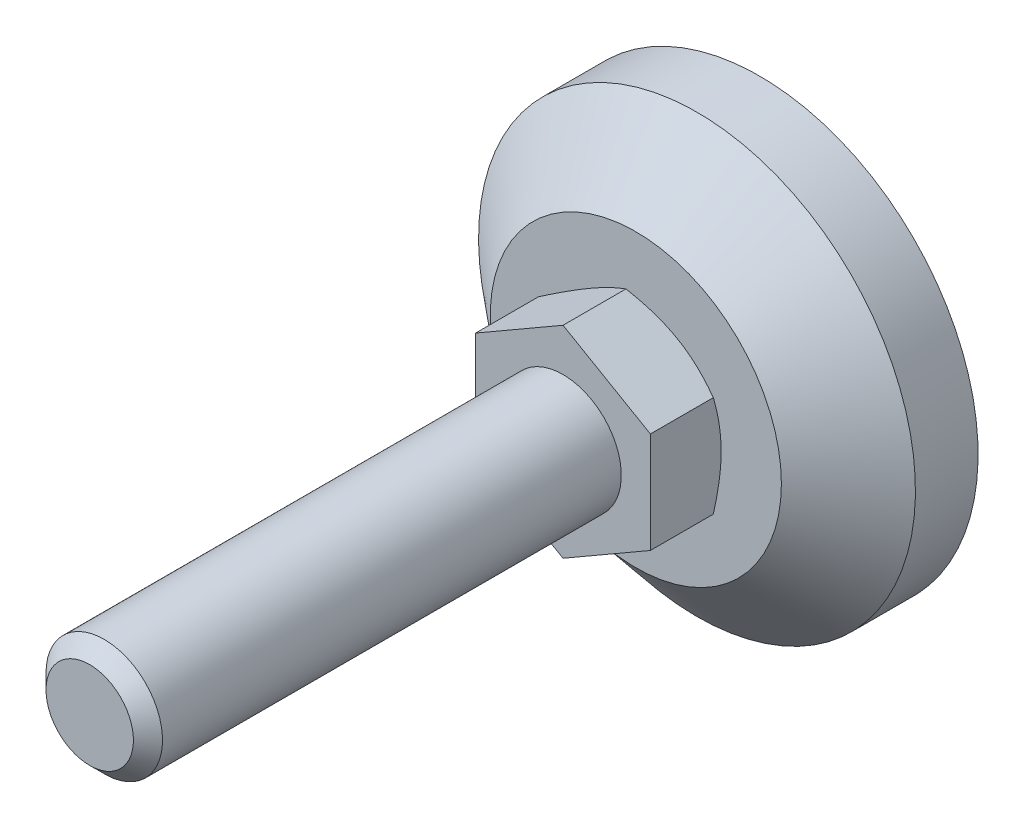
ISO-10303-21;
HEADER;
FILE_DESCRIPTION(('STEP AP214'),'2;1');
FILE_NAME('part.step','',(''),(''),'','','');
FILE_SCHEMA(('AUTOMOTIVE_DESIGN { 1 0 10303 214 1 1 1 1 }'));
ENDSEC;
DATA;
#1=APPLICATION_CONTEXT('core data for automotive mechanical design processes');
#2=APPLICATION_PROTOCOL_DEFINITION('international standard','automotive_design',2000,#1);
#3=PRODUCT_CONTEXT('',#1,'mechanical');
#4=PRODUCT('Part','Part','',(#3));
#5=PRODUCT_RELATED_PRODUCT_CATEGORY('part','',(#4));
#6=PRODUCT_DEFINITION_FORMATION('','',#4);
#7=PRODUCT_DEFINITION_CONTEXT('part definition',#1,'design');
#8=PRODUCT_DEFINITION('design','',#6,#7);
#9=PRODUCT_DEFINITION_SHAPE('','',#8);
#10=(LENGTH_UNIT() NAMED_UNIT(*) SI_UNIT(.MILLI.,.METRE.));
#11=(NAMED_UNIT(*) PLANE_ANGLE_UNIT() SI_UNIT($,.RADIAN.));
#12=(NAMED_UNIT(*) SI_UNIT($,.STERADIAN.) SOLID_ANGLE_UNIT());
#13=UNCERTAINTY_MEASURE_WITH_UNIT(LENGTH_MEASURE(1.E-05),#10,'distance_accuracy_value','');
#14=(GEOMETRIC_REPRESENTATION_CONTEXT(3) GLOBAL_UNCERTAINTY_ASSIGNED_CONTEXT((#13)) GLOBAL_UNIT_ASSIGNED_CONTEXT((#10,
#11,#12)) REPRESENTATION_CONTEXT('',''));
#15=CARTESIAN_POINT('',(0.,0.,0.));
#16=DIRECTION('',(0.,0.,1.));
#17=DIRECTION('',(1.,0.,0.));
#18=AXIS2_PLACEMENT_3D('',#15,#16,#17);
#19=CARTESIAN_POINT('',(0.,0.,27.));
#20=DIRECTION('',(0.,0.,1.));
#21=DIRECTION('',(0.5,-0.866025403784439,0.));
#22=AXIS2_PLACEMENT_3D('',#19,#20,#21);
#23=PLANE('',#22);
#24=DIRECTION('',(0.,1.,0.));
#25=VECTOR('',#24,1.);
#26=CARTESIAN_POINT('',(12.,-6.92820323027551,27.));
#27=LINE('',#26,#25);
#28=CARTESIAN_POINT('',(12.,-6.92820323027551,27.));
#29=VERTEX_POINT('',#28);
#30=CARTESIAN_POINT('',(12.,6.92820323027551,27.));
#31=VERTEX_POINT('',#30);
#32=EDGE_CURVE('E197',#29,#31,#27,.T.);
#33=ORIENTED_EDGE('',*,*,#32,.T.);
#34=DIRECTION('',(-0.866025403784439,0.5,0.));
#35=VECTOR('',#34,1.);
#36=CARTESIAN_POINT('',(12.,6.92820323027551,27.));
#37=LINE('',#36,#35);
#38=CARTESIAN_POINT('',(0.,13.856406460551,27.));
#39=VERTEX_POINT('',#38);
#40=EDGE_CURVE('E320',#31,#39,#37,.T.);
#41=ORIENTED_EDGE('',*,*,#40,.T.);
#42=DIRECTION('',(-0.866025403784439,-0.5,0.));
#43=VECTOR('',#42,1.);
#44=CARTESIAN_POINT('',(0.,13.856406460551,27.));
#45=LINE('',#44,#43);
#46=CARTESIAN_POINT('',(-12.,6.92820323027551,27.));
#47=VERTEX_POINT('',#46);
#48=EDGE_CURVE('E319',#39,#47,#45,.T.);
#49=ORIENTED_EDGE('',*,*,#48,.T.);
#50=DIRECTION('',(0.,-1.,0.));
#51=VECTOR('',#50,1.);
#52=CARTESIAN_POINT('',(-12.,6.92820323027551,27.));
#53=LINE('',#52,#51);
#54=CARTESIAN_POINT('',(-12.,-6.92820323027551,27.));
#55=VERTEX_POINT('',#54);
#56=EDGE_CURVE('E324',#47,#55,#53,.T.);
#57=ORIENTED_EDGE('',*,*,#56,.T.);
#58=DIRECTION('',(0.866025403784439,-0.5,0.));
#59=VECTOR('',#58,1.);
#60=CARTESIAN_POINT('',(-12.,-6.92820323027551,27.));
#61=LINE('',#60,#59);
#62=CARTESIAN_POINT('',(0.,-13.856406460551,27.));
#63=VERTEX_POINT('',#62);
#64=EDGE_CURVE('E326',#55,#63,#61,.T.);
#65=ORIENTED_EDGE('',*,*,#64,.T.);
#66=DIRECTION('',(0.866025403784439,0.5,0.));
#67=VECTOR('',#66,1.);
#68=CARTESIAN_POINT('',(0.,-13.856406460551,27.));
#69=LINE('',#68,#67);
#70=EDGE_CURVE('E37',#63,#29,#69,.T.);
#71=ORIENTED_EDGE('',*,*,#70,.T.);
#72=EDGE_LOOP('',(#33,#41,#49,#57,#65,#71));
#73=FACE_BOUND('',#72,.T.);
#74=CARTESIAN_POINT('',(0.,0.,27.));
#75=DIRECTION('',(0.,0.,1.));
#76=DIRECTION('',(0.5,-0.866025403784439,0.));
#77=AXIS2_PLACEMENT_3D('',#74,#75,#76);
#78=CIRCLE('',#77,8.);
#79=CARTESIAN_POINT('',(4.,-6.92820323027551,27.));
#80=VERTEX_POINT('',#79);
#81=EDGE_CURVE('E201',#80,#80,#78,.T.);
#82=ORIENTED_EDGE('',*,*,#81,.F.);
#83=EDGE_LOOP('',(#82));
#84=FACE_BOUND('',#83,.T.);
#85=ADVANCED_FACE('F14',(#73,#84),#23,.T.);
#86=CARTESIAN_POINT('',(-9.99463491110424,17.3112154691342,17.));
#87=DIRECTION('',(0.,0.,1.));
#88=DIRECTION('',(0.5,-0.866025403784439,0.));
#89=AXIS2_PLACEMENT_3D('',#86,#87,#88);
#90=PLANE('',#89);
#91=CARTESIAN_POINT('',(0.,0.,17.));
#92=DIRECTION('',(0.,0.,-1.));
#93=DIRECTION('',(-0.5,0.866025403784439,0.));
#94=AXIS2_PLACEMENT_3D('',#91,#92,#93);
#95=CIRCLE('',#94,19.9892698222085);
#96=CARTESIAN_POINT('',(-9.99463491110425,17.3112154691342,17.));
#97=VERTEX_POINT('',#96);
#98=EDGE_CURVE('E102',#97,#97,#95,.T.);
#99=ORIENTED_EDGE('',*,*,#98,.F.);
#100=EDGE_LOOP('',(#99));
#101=FACE_BOUND('',#100,.T.);
#102=CARTESIAN_POINT('',(0.,0.,17.));
#103=DIRECTION('',(0.,0.,-1.));
#104=DIRECTION('',(-0.5,0.866025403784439,0.));
#105=AXIS2_PLACEMENT_3D('',#102,#103,#104);
#106=CIRCLE('',#105,11.5);
#107=CARTESIAN_POINT('',(-5.75,9.95929214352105,17.));
#108=VERTEX_POINT('',#107);
#109=EDGE_CURVE('E84',#108,#108,#106,.T.);
#110=ORIENTED_EDGE('',*,*,#109,.T.);
#111=EDGE_LOOP('',(#110));
#112=FACE_BOUND('',#111,.T.);
#113=ADVANCED_FACE('F174',(#101,#112),#90,.T.);
#114=CARTESIAN_POINT('',(0.,0.,0.));
#115=DIRECTION('',(0.,0.,-1.));
#116=DIRECTION('',(-0.5,0.866025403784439,0.));
#117=AXIS2_PLACEMENT_3D('',#114,#115,#116);
#118=PLANE('',#117);
#119=CARTESIAN_POINT('',(0.,0.,0.));
#120=DIRECTION('',(0.,0.,-1.));
#121=DIRECTION('',(-0.5,0.866025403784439,0.));
#122=AXIS2_PLACEMENT_3D('',#119,#120,#121);
#123=CIRCLE('',#122,30.);
#124=CARTESIAN_POINT('',(-15.,25.9807621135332,0.));
#125=VERTEX_POINT('',#124);
#126=EDGE_CURVE('E73',#125,#125,#123,.T.);
#127=ORIENTED_EDGE('',*,*,#126,.T.);
#128=EDGE_LOOP('',(#127));
#129=FACE_BOUND('',#128,.T.);
#130=ADVANCED_FACE('F177',(#129),#118,.T.);
#131=CARTESIAN_POINT('',(0.,0.,-75.4972525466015));
#132=DIRECTION('',(0.,0.,-1.));
#133=DIRECTION('',(-0.5,0.866025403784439,0.));
#134=AXIS2_PLACEMENT_3D('',#131,#132,#133);
#135=CYLINDRICAL_SURFACE('',#134,30.);
#136=CARTESIAN_POINT('',(0.,0.,8.6));
#137=DIRECTION('',(0.,0.,-1.));
#138=DIRECTION('',(-0.5,0.866025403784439,0.));
#139=AXIS2_PLACEMENT_3D('',#136,#137,#138);
#140=CIRCLE('',#139,30.);
#141=CARTESIAN_POINT('',(-15.,25.9807621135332,8.6));
#142=VERTEX_POINT('',#141);
#143=EDGE_CURVE('E105',#142,#142,#140,.T.);
#144=ORIENTED_EDGE('',*,*,#143,.T.);
#145=EDGE_LOOP('',(#144));
#146=FACE_BOUND('',#145,.T.);
#147=ORIENTED_EDGE('',*,*,#126,.F.);
#148=EDGE_LOOP('',(#147));
#149=FACE_BOUND('',#148,.T.);
#150=ADVANCED_FACE('F181',(#146,#149),#135,.T.);
#151=CARTESIAN_POINT('',(0.,0.,8.6));
#152=DIRECTION('',(0.,0.,-1.));
#153=DIRECTION('',(-0.5,0.866025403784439,0.));
#154=AXIS2_PLACEMENT_3D('',#151,#152,#153);
#155=CONICAL_SURFACE('',#154,30.,0.872664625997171);
#156=ORIENTED_EDGE('',*,*,#98,.T.);
#157=EDGE_LOOP('',(#156));
#158=FACE_BOUND('',#157,.T.);
#159=ORIENTED_EDGE('',*,*,#143,.F.);
#160=EDGE_LOOP('',(#159));
#161=FACE_BOUND('',#160,.T.);
#162=ADVANCED_FACE('F121',(#158,#161),#155,.T.);
#163=CARTESIAN_POINT('',(0.,0.,20.8975219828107));
#164=DIRECTION('',(0.,0.,1.));
#165=DIRECTION('',(0.5,-0.866025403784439,0.));
#166=AXIS2_PLACEMENT_3D('',#163,#164,#165);
#167=CONICAL_SURFACE('',#166,18.2507060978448,1.0471975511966);
#168=ORIENTED_EDGE('',*,*,#109,.F.);
#169=EDGE_LOOP('',(#168));
#170=FACE_BOUND('',#169,.T.);
#171=CARTESIAN_POINT('',(-10.1845483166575,-19.7364581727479,23.1830146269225));
#172=CARTESIAN_POINT('',(-9.95731802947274,-19.6052667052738,23.0555465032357));
#173=CARTESIAN_POINT('',(-9.72982292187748,-19.4739223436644,22.9287081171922));
#174=CARTESIAN_POINT('',(-9.27424782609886,-19.2108959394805,22.6764332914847));
#175=CARTESIAN_POINT('',(-9.04616783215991,-19.0792138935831,22.5509968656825));
#176=CARTESIAN_POINT('',(-8.360907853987,-18.6835788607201,22.1769716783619));
#177=CARTESIAN_POINT('',(-7.90277404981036,-18.4190751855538,21.930704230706));
#178=CARTESIAN_POINT('',(-6.98100239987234,-17.8868900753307,21.4445247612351));
#179=CARTESIAN_POINT('',(-6.51734820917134,-17.6191992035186,21.2046539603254));
#180=CARTESIAN_POINT('',(-5.58637620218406,-17.0817022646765,20.734620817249));
#181=CARTESIAN_POINT('',(-5.11905855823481,-16.8118962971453,20.5044580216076));
#182=CARTESIAN_POINT('',(-4.16467967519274,-16.2608853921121,20.0490896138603));
#183=CARTESIAN_POINT('',(-3.67747196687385,-15.9795958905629,19.82429119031));
#184=CARTESIAN_POINT('',(-2.69737824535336,-15.413738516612,19.3915182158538));
#185=CARTESIAN_POINT('',(-2.20449160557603,-15.1291702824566,19.1835455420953));
#186=CARTESIAN_POINT('',(-1.21317256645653,-14.5568319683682,18.7898295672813));
#187=CARTESIAN_POINT('',(-0.714753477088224,-14.2690695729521,18.6040419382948));
#188=CARTESIAN_POINT('',(0.289281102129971,-13.6893899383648,18.2605950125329));
#189=CARTESIAN_POINT('',(0.794894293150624,-13.3974740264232,18.1029269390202));
#190=CARTESIAN_POINT('',(1.55740346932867,-12.9572391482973,17.8936125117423));
#191=CARTESIAN_POINT('',(1.81154649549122,-12.8105096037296,17.82851512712));
#192=CARTESIAN_POINT('',(2.3215816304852,-12.5160406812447,17.7081511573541));
#193=CARTESIAN_POINT('',(2.57747370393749,-12.3683013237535,17.652884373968));
#194=CARTESIAN_POINT('',(3.09083535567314,-12.0719118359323,17.5531523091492));
#195=CARTESIAN_POINT('',(3.34830490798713,-11.9232617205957,17.5086868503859));
#196=CARTESIAN_POINT('',(3.86455433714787,-11.6252049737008,17.4314414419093));
#197=CARTESIAN_POINT('',(4.12333416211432,-11.4757983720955,17.3986610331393));
#198=CARTESIAN_POINT('',(4.63843364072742,-11.1784055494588,17.345852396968));
#199=CARTESIAN_POINT('',(4.89474072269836,-11.0304265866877,17.3256616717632));
#200=CARTESIAN_POINT('',(5.40786438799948,-10.7341745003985,17.2978182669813));
#201=CARTESIAN_POINT('',(5.66468096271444,-10.5859013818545,17.2901653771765));
#202=CARTESIAN_POINT('',(6.17836497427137,-10.2893257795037,17.287579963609));
#203=CARTESIAN_POINT('',(6.43523241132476,-10.1410232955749,17.2926474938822));
#204=CARTESIAN_POINT('',(6.94855188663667,-9.84465815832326,17.3153783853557));
#205=CARTESIAN_POINT('',(7.20500390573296,-9.69659551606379,17.3330423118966));
#206=CARTESIAN_POINT('',(7.81927447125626,-9.34194623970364,17.3900614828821));
#207=CARTESIAN_POINT('',(8.17669346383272,-9.13559028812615,17.4352607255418));
#208=CARTESIAN_POINT('',(8.88892563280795,-8.72438285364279,17.5476838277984));
#209=CARTESIAN_POINT('',(9.24373845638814,-8.51953157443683,17.6149106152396));
#210=CARTESIAN_POINT('',(9.95040329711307,-8.11153843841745,17.7689975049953));
#211=CARTESIAN_POINT('',(10.3022528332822,-7.90839801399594,17.8558726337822));
#212=CARTESIAN_POINT('',(11.0024455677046,-7.50414155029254,18.0466010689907));
#213=CARTESIAN_POINT('',(11.3507888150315,-7.30302548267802,18.1504541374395));
#214=CARTESIAN_POINT('',(12.0517118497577,-6.89834737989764,18.3750877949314));
#215=CARTESIAN_POINT('',(12.4042127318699,-6.69483090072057,18.4961943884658));
#216=CARTESIAN_POINT('',(13.1057427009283,-6.28980238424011,18.7510771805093));
#217=CARTESIAN_POINT('',(13.4547717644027,-6.08829036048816,18.8848534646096));
#218=CARTESIAN_POINT('',(14.1495287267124,-5.68717224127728,19.1629377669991));
#219=CARTESIAN_POINT('',(14.4952576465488,-5.48756555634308,19.3072424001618));
#220=CARTESIAN_POINT('',(15.1838410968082,-5.09001171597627,19.6046702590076));
#221=CARTESIAN_POINT('',(15.5266956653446,-4.89206453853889,19.7577933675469));
#222=CARTESIAN_POINT('',(16.3531119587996,-4.41493286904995,20.1371587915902));
#223=CARTESIAN_POINT('',(16.8353860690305,-4.13649178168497,20.3671360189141));
#224=CARTESIAN_POINT('',(17.7956874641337,-3.58206151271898,20.838658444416));
#225=CARTESIAN_POINT('',(18.2737144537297,-3.3060725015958,21.0802044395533));
#226=CARTESIAN_POINT('',(19.2263411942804,-2.75607319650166,21.572480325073));
#227=CARTESIAN_POINT('',(19.7009400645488,-2.48206341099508,21.8232124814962));
#228=CARTESIAN_POINT('',(20.647182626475,-1.93575001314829,22.3319518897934));
#229=CARTESIAN_POINT('',(21.1188263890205,-1.66344635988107,22.5899589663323));
#230=CARTESIAN_POINT('',(22.060219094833,-1.11993302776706,23.1121588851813));
#231=CARTESIAN_POINT('',(22.5299651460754,-0.848725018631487,23.3763586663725));
#232=CARTESIAN_POINT('',(23.4674052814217,-0.307493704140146,23.9095679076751));
#233=CARTESIAN_POINT('',(23.9350993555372,-0.037470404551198,24.1785773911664));
#234=CARTESIAN_POINT('',(24.8686924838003,0.50153983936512,24.7205226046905));
#235=CARTESIAN_POINT('',(25.3345917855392,0.770526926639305,24.9934577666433));
#236=CARTESIAN_POINT('',(26.2649273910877,1.30765643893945,25.5426344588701));
#237=CARTESIAN_POINT('',(26.7293636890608,1.57579886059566,25.8188760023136));
#238=CARTESIAN_POINT('',(28.0397530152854,2.33235249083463,26.6032315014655));
#239=CARTESIAN_POINT('',(28.8842584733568,2.81992794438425,27.1145698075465));
#240=CARTESIAN_POINT('',(30.5701660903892,3.79328716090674,28.1440983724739));
#241=CARTESIAN_POINT('',(31.4115681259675,4.27907085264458,28.6622889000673));
#242=CARTESIAN_POINT('',(33.0897202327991,5.24795242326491,29.7025139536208));
#243=CARTESIAN_POINT('',(33.9264767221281,5.73105400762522,30.2245346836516));
#244=CARTESIAN_POINT('',(35.1801565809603,6.45486641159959,31.0105887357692));
#245=CARTESIAN_POINT('',(35.5977953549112,6.69599027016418,31.2731029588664));
#246=CARTESIAN_POINT('',(36.4326440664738,7.17799039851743,31.7990373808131));
#247=CARTESIAN_POINT('',(36.8498540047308,7.41886666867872,32.0624575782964));
#248=CARTESIAN_POINT('',(37.2668741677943,7.65963337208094,32.3262778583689));
#249=B_SPLINE_CURVE_WITH_KNOTS('',3,(#171,#172,#173,#174,#175,#176,#177,#178,#179,#180,#181,
#182,#183,#184,#185,#186,#187,#188,#189,#190,#191,#192,#193,#194,#195,#196,#197,#198,#199,#200,
#201,#202,#203,#204,#205,#206,#207,#208,#209,#210,#211,#212,#213,#214,#215,#216,#217,#218,#219,
#220,#221,#222,#223,#224,#225,#226,#227,#228,#229,#230,#231,#232,#233,#234,#235,#236,#237,#238,
#239,#240,#241,#242,#243,#244,#245,#246,#247,#248),.UNSPECIFIED.,.F.,.F.,(4,2,2,2,2,2,2,2,2,2,2,
2,2,2,2,2,2,2,2,2,2,2,2,2,2,2,2,2,2,2,2,2,2,2,2,2,2,2,4),(0.,0.875119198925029,1.75024704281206,
3.50075771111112,5.26066680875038,7.02049360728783,8.8377767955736,10.6552624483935,
12.469053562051,14.2822775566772,15.1839173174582,16.085538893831,16.9871456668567,
17.8887170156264,18.7783966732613,19.6680614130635,20.5577299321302,21.4474383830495,
22.6922901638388,23.9373074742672,25.1832801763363,26.4292354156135,27.7029922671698,
28.9767577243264,30.2501154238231,31.5234562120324,33.3307782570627,35.1382249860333,
36.9461206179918,38.7539727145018,40.5639577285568,42.3739515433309,44.1836860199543,
45.9934277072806,49.2966384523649,52.5999791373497,55.8945808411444,57.5417866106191,
59.1889898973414),.UNSPECIFIED.);
#250=CARTESIAN_POINT('',(0.,-13.856406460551,18.3604719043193));
#251=VERTEX_POINT('',#250);
#252=CARTESIAN_POINT('',(12.,-6.92820323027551,18.3604719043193));
#253=VERTEX_POINT('',#252);
#254=EDGE_CURVE('E65',#251,#253,#249,.T.);
#255=ORIENTED_EDGE('',*,*,#254,.F.);
#256=CARTESIAN_POINT('',(-12.0002,-6.92808776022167,18.3605385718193));
#257=CARTESIAN_POINT('',(-11.7364142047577,-7.08038456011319,18.2726247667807));
#258=CARTESIAN_POINT('',(-11.4716448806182,-7.2332492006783,18.1887011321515));
#259=CARTESIAN_POINT('',(-10.9399829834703,-7.54020434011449,18.0299413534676));
#260=CARTESIAN_POINT('',(-10.6730897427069,-7.69429522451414,17.9551081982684));
#261=CARTESIAN_POINT('',(-9.86810959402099,-8.15905073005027,17.7456926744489));
#262=CARTESIAN_POINT('',(-9.3268449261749,-8.47155003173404,17.6265783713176));
#263=CARTESIAN_POINT('',(-8.51686717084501,-8.93919090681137,17.4869061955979));
#264=CARTESIAN_POINT('',(-8.25057389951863,-9.09293539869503,17.4471189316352));
#265=CARTESIAN_POINT('',(-7.71675440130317,-9.40113622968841,17.3803985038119));
#266=CARTESIAN_POINT('',(-7.44922815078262,-9.55559258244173,17.3534655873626));
#267=CARTESIAN_POINT('',(-6.91372963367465,-9.86476279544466,17.3131437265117));
#268=CARTESIAN_POINT('',(-6.64575827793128,-10.0194761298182,17.2997386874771));
#269=CARTESIAN_POINT('',(-6.10956726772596,-10.3290461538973,17.286758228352));
#270=CARTESIAN_POINT('',(-5.84134762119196,-10.4839028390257,17.2871823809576));
#271=CARTESIAN_POINT('',(-5.33991062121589,-10.7734076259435,17.3008951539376));
#272=CARTESIAN_POINT('',(-5.10665750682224,-10.908076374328,17.3125111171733));
#273=CARTESIAN_POINT('',(-4.64068775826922,-11.1771041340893,17.3459831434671));
#274=CARTESIAN_POINT('',(-4.40797116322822,-11.3114631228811,17.367839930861));
#275=CARTESIAN_POINT('',(-3.94320092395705,-11.5797983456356,17.4214125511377));
#276=CARTESIAN_POINT('',(-3.71114798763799,-11.7137741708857,17.4531365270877));
#277=CARTESIAN_POINT('',(-3.24813003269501,-11.9810977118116,17.5258869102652));
#278=CARTESIAN_POINT('',(-3.01716508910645,-12.1144453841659,17.566913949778));
#279=CARTESIAN_POINT('',(-2.31605804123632,-12.5192297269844,17.7049867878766));
#280=CARTESIAN_POINT('',(-1.84794625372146,-12.789494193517,17.8158000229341));
#281=CARTESIAN_POINT('',(-0.918702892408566,-13.3259930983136,18.0673009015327));
#282=CARTESIAN_POINT('',(-0.457559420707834,-13.5922344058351,18.2079294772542));
#283=CARTESIAN_POINT('',(0.000200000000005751,-13.8565219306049,18.3605385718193));
#284=B_SPLINE_CURVE_WITH_KNOTS('',3,(#256,#257,#258,#259,#260,#261,#262,#263,#264,#265,#266,
#267,#268,#269,#270,#271,#272,#273,#274,#275,#276,#277,#278,#279,#280,#281,#282,#283),
.UNSPECIFIED.,.F.,.F.,(4,2,2,2,2,2,2,2,2,2,2,2,2,4),(0.,0.951004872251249,1.90232158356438,
3.80900466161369,4.73894551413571,5.6689042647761,6.59775529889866,7.52657763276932,
8.3351464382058,9.14377244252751,9.95306755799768,10.7624176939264,12.4167102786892,
14.0677556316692),.UNSPECIFIED.);
#285=CARTESIAN_POINT('',(-12.,-6.92820323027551,18.3604719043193));
#286=VERTEX_POINT('',#285);
#287=EDGE_CURVE('E68',#286,#251,#284,.T.);
#288=ORIENTED_EDGE('',*,*,#287,.F.);
#289=CARTESIAN_POINT('',(-12.,6.92843417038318,18.3605385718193));
#290=CARTESIAN_POINT('',(-12.,6.62384057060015,18.2726247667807));
#291=CARTESIAN_POINT('',(-12.,6.31811128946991,18.1887011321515));
#292=CARTESIAN_POINT('',(-12.,5.70420101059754,18.0299413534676));
#293=CARTESIAN_POINT('',(-12.,5.39601924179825,17.9551081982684));
#294=CARTESIAN_POINT('',(-12.,4.46650823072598,17.7456926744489));
#295=CARTESIAN_POINT('',(-12.,3.84150962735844,17.6265783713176));
#296=CARTESIAN_POINT('',(-12.,2.90622787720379,17.4869061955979));
#297=CARTESIAN_POINT('',(-12.,2.59873889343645,17.4471189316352));
#298=CARTESIAN_POINT('',(-12.,1.98233723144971,17.3803985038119));
#299=CARTESIAN_POINT('',(-12.,1.67342452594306,17.3534655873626));
#300=CARTESIAN_POINT('',(-12.,1.05508409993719,17.3131437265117));
#301=CARTESIAN_POINT('',(-12.,0.745657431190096,17.2997386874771));
#302=CARTESIAN_POINT('',(-12.,0.126517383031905,17.286758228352));
#303=CARTESIAN_POINT('',(-12.,-0.183195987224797,17.2871823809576));
#304=CARTESIAN_POINT('',(-12.,-0.76220556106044,17.3008951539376));
#305=CARTESIAN_POINT('',(-12.,-1.03154305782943,17.3125111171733));
#306=CARTESIAN_POINT('',(-12.,-1.56959857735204,17.3459831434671));
#307=CARTESIAN_POINT('',(-12.,-1.83831655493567,17.367839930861));
#308=CARTESIAN_POINT('',(-12.,-2.37498700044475,17.4214125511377));
#309=CARTESIAN_POINT('',(-12.,-2.64293865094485,17.4531365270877));
#310=CARTESIAN_POINT('',(-12.,-3.17758573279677,17.5258869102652));
#311=CARTESIAN_POINT('',(-12.,-3.44428107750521,17.566913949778));
#312=CARTESIAN_POINT('',(-12.,-4.25384976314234,17.7049867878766));
#313=CARTESIAN_POINT('',(-12.,-4.79437869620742,17.8158000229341));
#314=CARTESIAN_POINT('',(-12.,-5.86737650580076,18.0673009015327));
#315=CARTESIAN_POINT('',(-12.,-6.39985912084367,18.2079294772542));
#316=CARTESIAN_POINT('',(-12.,-6.92843417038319,18.3605385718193));
#317=B_SPLINE_CURVE_WITH_KNOTS('',3,(#289,#290,#291,#292,#293,#294,#295,#296,#297,#298,#299,
#300,#301,#302,#303,#304,#305,#306,#307,#308,#309,#310,#311,#312,#313,#314,#315,#316),
.UNSPECIFIED.,.F.,.F.,(4,2,2,2,2,2,2,2,2,2,2,2,2,4),(0.,0.951004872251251,1.90232158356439,
3.80900466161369,4.73894551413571,5.6689042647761,6.59775529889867,7.52657763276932,
8.3351464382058,9.14377244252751,9.95306755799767,10.7624176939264,12.4167102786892,
14.0677556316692),.UNSPECIFIED.);
#318=CARTESIAN_POINT('',(-12.,6.92820323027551,18.3604719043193));
#319=VERTEX_POINT('',#318);
#320=EDGE_CURVE('E83',#319,#286,#317,.T.);
#321=ORIENTED_EDGE('',*,*,#320,.F.);
#322=CARTESIAN_POINT('',(-22.184548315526,1.04815151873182,23.1830146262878));
#323=CARTESIAN_POINT('',(-21.9573180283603,1.179342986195,23.0555465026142));
#324=CARTESIAN_POINT('',(-21.729822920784,1.31068734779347,22.9287081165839));
#325=CARTESIAN_POINT('',(-21.2742478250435,1.57371375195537,22.676433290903));
#326=CARTESIAN_POINT('',(-21.0461678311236,1.7053957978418,22.550996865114));
#327=CARTESIAN_POINT('',(-20.3609078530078,2.1010308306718,22.1769716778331));
#328=CARTESIAN_POINT('',(-19.9027740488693,2.36553450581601,21.9307042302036));
#329=CARTESIAN_POINT('',(-18.9810023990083,2.89771961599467,21.4445247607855));
#330=CARTESIAN_POINT('',(-18.517348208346,3.16541048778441,21.2046539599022));
#331=CARTESIAN_POINT('',(-17.5863762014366,3.7029074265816,20.7346208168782));
#332=CARTESIAN_POINT('',(-17.1190585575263,3.97271339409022,20.5044580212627));
#333=CARTESIAN_POINT('',(-16.1646796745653,4.52372429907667,20.0490896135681));
#334=CARTESIAN_POINT('',(-15.6774719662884,4.80501380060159,19.8242911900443));
#335=CARTESIAN_POINT('',(-14.6973782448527,5.37087117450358,19.3915182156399));
#336=CARTESIAN_POINT('',(-14.2044916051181,5.65543940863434,19.1835455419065));
#337=CARTESIAN_POINT('',(-13.2131725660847,6.22777772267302,18.7898295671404));
#338=CARTESIAN_POINT('',(-12.7147534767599,6.51554011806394,18.6040419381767));
#339=CARTESIAN_POINT('',(-11.7107188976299,7.09521975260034,18.2605950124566));
#340=CARTESIAN_POINT('',(-11.2051057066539,7.38713566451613,18.1029269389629));
#341=CARTESIAN_POINT('',(-10.4425965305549,7.82737054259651,17.8936125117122));
#342=CARTESIAN_POINT('',(-10.1884535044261,7.97410008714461,17.8285151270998));
#343=CARTESIAN_POINT('',(-9.67841836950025,8.26856900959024,17.7081511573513));
#344=CARTESIAN_POINT('',(-9.42252629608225,8.41630836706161,17.6528843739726));
#345=CARTESIAN_POINT('',(-8.90916464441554,8.71269785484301,17.5531523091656));
#346=CARTESIAN_POINT('',(-8.6516950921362,8.86134797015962,17.5086868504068));
#347=CARTESIAN_POINT('',(-8.13544566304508,9.15940471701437,17.4314414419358));
#348=CARTESIAN_POINT('',(-7.87666583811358,9.30881131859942,17.3986610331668));
#349=CARTESIAN_POINT('',(-7.36156635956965,9.60620414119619,17.3458523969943));
#350=CARTESIAN_POINT('',(-7.10525927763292,9.75418310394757,17.3256616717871));
#351=CARTESIAN_POINT('',(-6.59213561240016,10.0504351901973,17.2978182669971));
#352=CARTESIAN_POINT('',(-6.33531903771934,10.1987083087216,17.2901653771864));
#353=CARTESIAN_POINT('',(-5.82163502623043,10.4952839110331,17.2875799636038));
#354=CARTESIAN_POINT('',(-5.56476758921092,10.6435863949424,17.2926474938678));
#355=CARTESIAN_POINT('',(-5.05144811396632,10.9399515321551,17.3153783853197));
#356=CARTESIAN_POINT('',(-4.79499609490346,11.0880141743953,17.3330423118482));
#357=CARTESIAN_POINT('',(-4.18072552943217,11.4426634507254,17.3900614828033));
#358=CARTESIAN_POINT('',(-3.82330653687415,11.6490194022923,17.4352607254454));
#359=CARTESIAN_POINT('',(-3.11107436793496,12.0602268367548,17.547683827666));
#360=CARTESIAN_POINT('',(-2.75626154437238,12.2650781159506,17.6149106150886));
#361=CARTESIAN_POINT('',(-2.04959670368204,12.67307125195,17.768997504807));
#362=CARTESIAN_POINT('',(-1.69774716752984,12.8762116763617,17.8558726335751));
#363=CARTESIAN_POINT('',(-0.997554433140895,13.2804681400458,18.0466010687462));
#364=CARTESIAN_POINT('',(-0.649211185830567,13.4815842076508,18.1504541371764));
#365=CARTESIAN_POINT('',(0.0517118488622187,13.8862623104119,18.3750877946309));
#366=CARTESIAN_POINT('',(0.404212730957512,14.0897787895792,18.4961943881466));
#367=CARTESIAN_POINT('',(1.10574269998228,14.4948073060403,18.7510771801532));
#368=CARTESIAN_POINT('',(1.45477176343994,14.6963193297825,18.8848534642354));
#369=CARTESIAN_POINT('',(2.1495287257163,15.0974374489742,19.1629377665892));
#370=CARTESIAN_POINT('',(2.49525764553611,15.2970441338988,19.3072423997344));
#371=CARTESIAN_POINT('',(3.18384109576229,15.6945979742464,19.6046702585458));
#372=CARTESIAN_POINT('',(3.52669566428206,15.8925451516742,19.7577933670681));
#373=CARTESIAN_POINT('',(4.3531119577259,16.3696768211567,20.1371587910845));
#374=CARTESIAN_POINT('',(4.83538606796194,16.6481179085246,20.3671360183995));
#375=CARTESIAN_POINT('',(5.7956874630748,17.2025481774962,20.838658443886));
#376=CARTESIAN_POINT('',(6.27371445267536,17.478537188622,21.0802044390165));
#377=CARTESIAN_POINT('',(7.22634119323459,18.0285364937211,21.5724803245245));
#378=CARTESIAN_POINT('',(7.7009400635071,18.30254627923,21.8232124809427));
#379=CARTESIAN_POINT('',(8.64718262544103,18.8488596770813,22.3319518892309));
#380=CARTESIAN_POINT('',(9.11882638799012,19.1211633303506,22.589958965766));
#381=CARTESIAN_POINT('',(10.0602190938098,19.6646766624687,23.1121588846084));
#382=CARTESIAN_POINT('',(10.5299651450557,19.9358846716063,23.3763586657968));
#383=CARTESIAN_POINT('',(11.4674052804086,20.4771159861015,23.9095679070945));
#384=CARTESIAN_POINT('',(11.9350993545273,20.7471392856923,24.1785773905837));
#385=CARTESIAN_POINT('',(12.8686924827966,21.2861495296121,24.7205226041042));
#386=CARTESIAN_POINT('',(13.3345917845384,21.555136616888,24.9934577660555));
#387=CARTESIAN_POINT('',(14.2649273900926,22.0922661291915,25.5426344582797));
#388=CARTESIAN_POINT('',(14.7293636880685,22.3604085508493,25.8188760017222));
#389=CARTESIAN_POINT('',(16.0397530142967,23.1169621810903,26.6032315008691));
#390=CARTESIAN_POINT('',(16.8842584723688,23.6045376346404,27.1145698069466));
#391=CARTESIAN_POINT('',(18.5701660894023,24.5778968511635,28.1440983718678));
#392=CARTESIAN_POINT('',(19.411568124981,25.0636805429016,28.6622888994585));
#393=CARTESIAN_POINT('',(21.0897202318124,26.0325621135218,29.7025139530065));
#394=CARTESIAN_POINT('',(21.9264767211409,26.5156636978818,30.2245346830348));
#395=CARTESIAN_POINT('',(23.1801565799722,27.2394761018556,31.0105887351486));
#396=CARTESIAN_POINT('',(23.5977953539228,27.48059996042,31.2731029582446));
#397=CARTESIAN_POINT('',(24.4326440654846,27.9626000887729,31.799037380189));
#398=CARTESIAN_POINT('',(24.8498540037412,28.2034763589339,32.0624575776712));
#399=CARTESIAN_POINT('',(25.2668741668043,28.4442430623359,32.3262778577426));
#400=B_SPLINE_CURVE_WITH_KNOTS('',3,(#322,#323,#324,#325,#326,#327,#328,#329,#330,#331,#332,
#333,#334,#335,#336,#337,#338,#339,#340,#341,#342,#343,#344,#345,#346,#347,#348,#349,#350,#351,
#352,#353,#354,#355,#356,#357,#358,#359,#360,#361,#362,#363,#364,#365,#366,#367,#368,#369,#370,
#371,#372,#373,#374,#375,#376,#377,#378,#379,#380,#381,#382,#383,#384,#385,#386,#387,#388,#389,
#390,#391,#392,#393,#394,#395,#396,#397,#398,#399),.UNSPECIFIED.,.F.,.F.,(4,2,2,2,2,2,2,2,2,2,2,
2,2,2,2,2,2,2,2,2,2,2,2,2,2,2,2,2,2,2,2,2,2,2,2,2,2,2,4),(0.,0.875119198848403,1.7502470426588,
3.50075771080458,5.2606668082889,7.02049360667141,8.83777679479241,10.6552624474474,
12.4690535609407,14.2822775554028,15.183917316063,16.085538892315,16.9871456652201,
17.8887170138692,18.7783966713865,19.668061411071,20.55772993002,21.4474383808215,
22.6922901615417,23.9373074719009,25.1832801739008,26.4292354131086,27.7029922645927,
28.9767577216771,30.2501154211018,31.523456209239,33.3307782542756,35.1382249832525,
36.9461206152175,38.7539727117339,40.5639577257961,42.3739515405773,44.1836860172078,
45.9934277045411,49.2966384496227,52.5999791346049,55.8945808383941,57.541786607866,
59.1889898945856),.UNSPECIFIED.);
#401=CARTESIAN_POINT('',(0.,13.856406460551,18.3604719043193));
#402=VERTEX_POINT('',#401);
#403=EDGE_CURVE('E143',#402,#319,#400,.F.);
#404=ORIENTED_EDGE('',*,*,#403,.F.);
#405=CARTESIAN_POINT('',(12.0002,6.92808776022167,18.3605385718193));
#406=CARTESIAN_POINT('',(11.7364142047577,7.08038456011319,18.2726247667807));
#407=CARTESIAN_POINT('',(11.4716448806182,7.2332492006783,18.1887011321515));
#408=CARTESIAN_POINT('',(10.9399829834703,7.54020434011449,18.0299413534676));
#409=CARTESIAN_POINT('',(10.6730897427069,7.69429522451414,17.9551081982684));
#410=CARTESIAN_POINT('',(9.86810959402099,8.15905073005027,17.7456926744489));
#411=CARTESIAN_POINT('',(9.3268449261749,8.47155003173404,17.6265783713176));
#412=CARTESIAN_POINT('',(8.51686717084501,8.93919090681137,17.4869061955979));
#413=CARTESIAN_POINT('',(8.25057389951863,9.09293539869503,17.4471189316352));
#414=CARTESIAN_POINT('',(7.71675440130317,9.40113622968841,17.3803985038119));
#415=CARTESIAN_POINT('',(7.44922815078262,9.55559258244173,17.3534655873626));
#416=CARTESIAN_POINT('',(6.91372963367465,9.86476279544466,17.3131437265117));
#417=CARTESIAN_POINT('',(6.64575827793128,10.0194761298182,17.2997386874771));
#418=CARTESIAN_POINT('',(6.10956726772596,10.3290461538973,17.286758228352));
#419=CARTESIAN_POINT('',(5.84134762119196,10.4839028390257,17.2871823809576));
#420=CARTESIAN_POINT('',(5.33991062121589,10.7734076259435,17.3008951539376));
#421=CARTESIAN_POINT('',(5.10665750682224,10.908076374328,17.3125111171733));
#422=CARTESIAN_POINT('',(4.64068775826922,11.1771041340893,17.3459831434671));
#423=CARTESIAN_POINT('',(4.40797116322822,11.3114631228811,17.367839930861));
#424=CARTESIAN_POINT('',(3.94320092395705,11.5797983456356,17.4214125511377));
#425=CARTESIAN_POINT('',(3.71114798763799,11.7137741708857,17.4531365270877));
#426=CARTESIAN_POINT('',(3.24813003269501,11.9810977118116,17.5258869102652));
#427=CARTESIAN_POINT('',(3.01716508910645,12.1144453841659,17.566913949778));
#428=CARTESIAN_POINT('',(2.31605804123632,12.5192297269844,17.7049867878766));
#429=CARTESIAN_POINT('',(1.84794625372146,12.789494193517,17.8158000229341));
#430=CARTESIAN_POINT('',(0.918702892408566,13.3259930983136,18.0673009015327));
#431=CARTESIAN_POINT('',(0.457559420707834,13.5922344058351,18.2079294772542));
#432=CARTESIAN_POINT('',(-0.000200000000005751,13.8565219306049,18.3605385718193));
#433=B_SPLINE_CURVE_WITH_KNOTS('',3,(#405,#406,#407,#408,#409,#410,#411,#412,#413,#414,#415,
#416,#417,#418,#419,#420,#421,#422,#423,#424,#425,#426,#427,#428,#429,#430,#431,#432),
.UNSPECIFIED.,.F.,.F.,(4,2,2,2,2,2,2,2,2,2,2,2,2,4),(0.,0.951004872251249,1.90232158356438,
3.80900466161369,4.73894551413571,5.6689042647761,6.59775529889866,7.52657763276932,
8.3351464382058,9.14377244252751,9.95306755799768,10.7624176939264,12.4167102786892,
14.0677556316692),.UNSPECIFIED.);
#434=CARTESIAN_POINT('',(12.,6.92820323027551,18.3604719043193));
#435=VERTEX_POINT('',#434);
#436=EDGE_CURVE('E150',#435,#402,#433,.T.);
#437=ORIENTED_EDGE('',*,*,#436,.F.);
#438=CARTESIAN_POINT('',(12.,-6.92843417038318,18.3605385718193));
#439=CARTESIAN_POINT('',(12.,-6.62384057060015,18.2726247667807));
#440=CARTESIAN_POINT('',(12.,-6.31811128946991,18.1887011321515));
#441=CARTESIAN_POINT('',(12.,-5.70420101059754,18.0299413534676));
#442=CARTESIAN_POINT('',(12.,-5.39601924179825,17.9551081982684));
#443=CARTESIAN_POINT('',(12.,-4.46650823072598,17.7456926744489));
#444=CARTESIAN_POINT('',(12.,-3.84150962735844,17.6265783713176));
#445=CARTESIAN_POINT('',(12.,-2.90622787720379,17.4869061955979));
#446=CARTESIAN_POINT('',(12.,-2.59873889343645,17.4471189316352));
#447=CARTESIAN_POINT('',(12.,-1.98233723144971,17.3803985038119));
#448=CARTESIAN_POINT('',(12.,-1.67342452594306,17.3534655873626));
#449=CARTESIAN_POINT('',(12.,-1.05508409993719,17.3131437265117));
#450=CARTESIAN_POINT('',(12.,-0.745657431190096,17.2997386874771));
#451=CARTESIAN_POINT('',(12.,-0.126517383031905,17.286758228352));
#452=CARTESIAN_POINT('',(12.,0.183195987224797,17.2871823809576));
#453=CARTESIAN_POINT('',(12.,0.76220556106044,17.3008951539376));
#454=CARTESIAN_POINT('',(12.,1.03154305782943,17.3125111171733));
#455=CARTESIAN_POINT('',(12.,1.56959857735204,17.3459831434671));
#456=CARTESIAN_POINT('',(12.,1.83831655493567,17.367839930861));
#457=CARTESIAN_POINT('',(12.,2.37498700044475,17.4214125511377));
#458=CARTESIAN_POINT('',(12.,2.64293865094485,17.4531365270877));
#459=CARTESIAN_POINT('',(12.,3.17758573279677,17.5258869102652));
#460=CARTESIAN_POINT('',(12.,3.44428107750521,17.566913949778));
#461=CARTESIAN_POINT('',(12.,4.25384976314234,17.7049867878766));
#462=CARTESIAN_POINT('',(12.,4.79437869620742,17.8158000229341));
#463=CARTESIAN_POINT('',(12.,5.86737650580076,18.0673009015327));
#464=CARTESIAN_POINT('',(12.,6.39985912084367,18.2079294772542));
#465=CARTESIAN_POINT('',(12.,6.92843417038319,18.3605385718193));
#466=B_SPLINE_CURVE_WITH_KNOTS('',3,(#438,#439,#440,#441,#442,#443,#444,#445,#446,#447,#448,
#449,#450,#451,#452,#453,#454,#455,#456,#457,#458,#459,#460,#461,#462,#463,#464,#465),
.UNSPECIFIED.,.F.,.F.,(4,2,2,2,2,2,2,2,2,2,2,2,2,4),(0.,0.951004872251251,1.90232158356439,
3.80900466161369,4.73894551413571,5.6689042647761,6.59775529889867,7.52657763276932,
8.3351464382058,9.14377244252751,9.95306755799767,10.7624176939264,12.4167102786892,
14.0677556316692),.UNSPECIFIED.);
#467=EDGE_CURVE('E29',#253,#435,#466,.T.);
#468=ORIENTED_EDGE('',*,*,#467,.F.);
#469=EDGE_LOOP('',(#255,#288,#321,#404,#437,#468));
#470=FACE_BOUND('',#469,.T.);
#471=ADVANCED_FACE('F67',(#170,#470),#167,.T.);
#472=CARTESIAN_POINT('',(0.,-13.856406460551,27.));
#473=DIRECTION('',(-0.5,0.866025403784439,0.));
#474=DIRECTION('',(-0.866025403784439,-0.5,0.));
#475=AXIS2_PLACEMENT_3D('',#472,#473,#474);
#476=PLANE('',#475);
#477=DIRECTION('',(0.,0.,-1.));
#478=VECTOR('',#477,1.);
#479=CARTESIAN_POINT('',(0.,-13.856406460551,27.));
#480=LINE('',#479,#478);
#481=EDGE_CURVE('E80',#63,#251,#480,.T.);
#482=ORIENTED_EDGE('',*,*,#481,.T.);
#483=ORIENTED_EDGE('',*,*,#254,.T.);
#484=DIRECTION('',(0.,0.,-1.));
#485=VECTOR('',#484,1.);
#486=CARTESIAN_POINT('',(12.,-6.92820323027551,27.));
#487=LINE('',#486,#485);
#488=EDGE_CURVE('E87',#29,#253,#487,.T.);
#489=ORIENTED_EDGE('',*,*,#488,.F.);
#490=ORIENTED_EDGE('',*,*,#70,.F.);
#491=EDGE_LOOP('',(#482,#483,#489,#490));
#492=FACE_BOUND('',#491,.T.);
#493=ADVANCED_FACE('F86',(#492),#476,.F.);
#494=CARTESIAN_POINT('',(-12.,-6.92820323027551,27.));
#495=DIRECTION('',(0.5,0.866025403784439,0.));
#496=DIRECTION('',(-0.866025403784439,0.5,0.));
#497=AXIS2_PLACEMENT_3D('',#494,#495,#496);
#498=PLANE('',#497);
#499=DIRECTION('',(0.,0.,-1.));
#500=VECTOR('',#499,1.);
#501=CARTESIAN_POINT('',(-12.,-6.92820323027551,27.));
#502=LINE('',#501,#500);
#503=EDGE_CURVE('E82',#55,#286,#502,.T.);
#504=ORIENTED_EDGE('',*,*,#503,.T.);
#505=ORIENTED_EDGE('',*,*,#287,.T.);
#506=ORIENTED_EDGE('',*,*,#481,.F.);
#507=ORIENTED_EDGE('',*,*,#64,.F.);
#508=EDGE_LOOP('',(#504,#505,#506,#507));
#509=FACE_BOUND('',#508,.T.);
#510=ADVANCED_FACE('F78',(#509),#498,.F.);
#511=CARTESIAN_POINT('',(-12.,6.92820323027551,27.));
#512=DIRECTION('',(1.,0.,0.));
#513=DIRECTION('',(0.,1.,0.));
#514=AXIS2_PLACEMENT_3D('',#511,#512,#513);
#515=PLANE('',#514);
#516=DIRECTION('',(0.,0.,-1.));
#517=VECTOR('',#516,1.);
#518=CARTESIAN_POINT('',(-12.,6.92820323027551,27.));
#519=LINE('',#518,#517);
#520=EDGE_CURVE('E89',#47,#319,#519,.T.);
#521=ORIENTED_EDGE('',*,*,#520,.T.);
#522=ORIENTED_EDGE('',*,*,#320,.T.);
#523=ORIENTED_EDGE('',*,*,#503,.F.);
#524=ORIENTED_EDGE('',*,*,#56,.F.);
#525=EDGE_LOOP('',(#521,#522,#523,#524));
#526=FACE_BOUND('',#525,.T.);
#527=ADVANCED_FACE('F297',(#526),#515,.F.);
#528=CARTESIAN_POINT('',(0.,13.856406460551,27.));
#529=DIRECTION('',(0.5,-0.866025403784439,0.));
#530=DIRECTION('',(0.866025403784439,0.5,0.));
#531=AXIS2_PLACEMENT_3D('',#528,#529,#530);
#532=PLANE('',#531);
#533=DIRECTION('',(0.,0.,-1.));
#534=VECTOR('',#533,1.);
#535=CARTESIAN_POINT('',(0.,13.856406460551,27.));
#536=LINE('',#535,#534);
#537=EDGE_CURVE('E96',#39,#402,#536,.T.);
#538=ORIENTED_EDGE('',*,*,#537,.T.);
#539=ORIENTED_EDGE('',*,*,#403,.T.);
#540=ORIENTED_EDGE('',*,*,#520,.F.);
#541=ORIENTED_EDGE('',*,*,#48,.F.);
#542=EDGE_LOOP('',(#538,#539,#540,#541));
#543=FACE_BOUND('',#542,.T.);
#544=ADVANCED_FACE('F167',(#543),#532,.F.);
#545=CARTESIAN_POINT('',(12.,6.92820323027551,27.));
#546=DIRECTION('',(-0.5,-0.866025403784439,0.));
#547=DIRECTION('',(0.866025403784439,-0.5,0.));
#548=AXIS2_PLACEMENT_3D('',#545,#546,#547);
#549=PLANE('',#548);
#550=DIRECTION('',(0.,0.,-1.));
#551=VECTOR('',#550,1.);
#552=CARTESIAN_POINT('',(12.,6.92820323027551,27.));
#553=LINE('',#552,#551);
#554=EDGE_CURVE('E99',#31,#435,#553,.T.);
#555=ORIENTED_EDGE('',*,*,#554,.T.);
#556=ORIENTED_EDGE('',*,*,#436,.T.);
#557=ORIENTED_EDGE('',*,*,#537,.F.);
#558=ORIENTED_EDGE('',*,*,#40,.F.);
#559=EDGE_LOOP('',(#555,#556,#557,#558));
#560=FACE_BOUND('',#559,.T.);
#561=ADVANCED_FACE('F163',(#560),#549,.F.);
#562=CARTESIAN_POINT('',(12.,-6.92820323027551,27.));
#563=DIRECTION('',(-1.,0.,0.));
#564=DIRECTION('',(0.,-1.,0.));
#565=AXIS2_PLACEMENT_3D('',#562,#563,#564);
#566=PLANE('',#565);
#567=ORIENTED_EDGE('',*,*,#488,.T.);
#568=ORIENTED_EDGE('',*,*,#467,.T.);
#569=ORIENTED_EDGE('',*,*,#554,.F.);
#570=ORIENTED_EDGE('',*,*,#32,.F.);
#571=EDGE_LOOP('',(#567,#568,#569,#570));
#572=FACE_BOUND('',#571,.T.);
#573=ADVANCED_FACE('F166',(#572),#566,.F.);
#574=CARTESIAN_POINT('',(0.,0.,92.));
#575=DIRECTION('',(0.,0.,-1.));
#576=DIRECTION('',(-0.5,0.866025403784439,0.));
#577=AXIS2_PLACEMENT_3D('',#574,#575,#576);
#578=CYLINDRICAL_SURFACE('',#577,8.);
#579=CARTESIAN_POINT('',(0.,0.,90.));
#580=DIRECTION('',(0.,0.,1.));
#581=DIRECTION('',(0.5,-0.866025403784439,0.));
#582=AXIS2_PLACEMENT_3D('',#579,#580,#581);
#583=CIRCLE('',#582,8.);
#584=CARTESIAN_POINT('',(4.,-6.92820323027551,90.));
#585=VERTEX_POINT('',#584);
#586=EDGE_CURVE('E9',#585,#585,#583,.F.);
#587=ORIENTED_EDGE('',*,*,#586,.T.);
#588=EDGE_LOOP('',(#587));
#589=FACE_BOUND('',#588,.T.);
#590=ORIENTED_EDGE('',*,*,#81,.T.);
#591=EDGE_LOOP('',(#590));
#592=FACE_BOUND('',#591,.T.);
#593=ADVANCED_FACE('F123',(#589,#592),#578,.T.);
#594=CARTESIAN_POINT('',(0.,0.,92.));
#595=DIRECTION('',(0.,0.,1.));
#596=DIRECTION('',(0.5,-0.866025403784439,0.));
#597=AXIS2_PLACEMENT_3D('',#594,#595,#596);
#598=PLANE('',#597);
#599=CARTESIAN_POINT('',(0.,0.,92.));
#600=DIRECTION('',(0.,0.,1.));
#601=DIRECTION('',(0.5,-0.866025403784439,0.));
#602=AXIS2_PLACEMENT_3D('',#599,#600,#601);
#603=CIRCLE('',#602,6.);
#604=CARTESIAN_POINT('',(3.,-5.19615242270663,92.));
#605=VERTEX_POINT('',#604);
#606=EDGE_CURVE('E22',#605,#605,#603,.T.);
#607=ORIENTED_EDGE('',*,*,#606,.T.);
#608=EDGE_LOOP('',(#607));
#609=FACE_BOUND('',#608,.T.);
#610=ADVANCED_FACE('F208',(#609),#598,.T.);
#611=CARTESIAN_POINT('',(0.,0.,92.));
#612=DIRECTION('',(0.,0.,-1.));
#613=DIRECTION('',(-0.5,0.866025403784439,0.));
#614=AXIS2_PLACEMENT_3D('',#611,#612,#613);
#615=CONICAL_SURFACE('',#614,6.,0.785398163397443);
#616=ORIENTED_EDGE('',*,*,#586,.F.);
#617=EDGE_LOOP('',(#616));
#618=FACE_BOUND('',#617,.T.);
#619=ORIENTED_EDGE('',*,*,#606,.F.);
#620=EDGE_LOOP('',(#619));
#621=FACE_BOUND('',#620,.T.);
#622=ADVANCED_FACE('F16',(#618,#621),#615,.T.);
#623=CLOSED_SHELL('',(#85,#113,#130,#150,#162,#471,#493,#510,#527,#544,#561,#573,#593,#610,#622));
#624=MANIFOLD_SOLID_BREP('B1',#623);
#625=ADVANCED_BREP_SHAPE_REPRESENTATION('',(#18,#624),#14);
#626=SHAPE_DEFINITION_REPRESENTATION(#9,#625);
ENDSEC;
END-ISO-10303-21;
